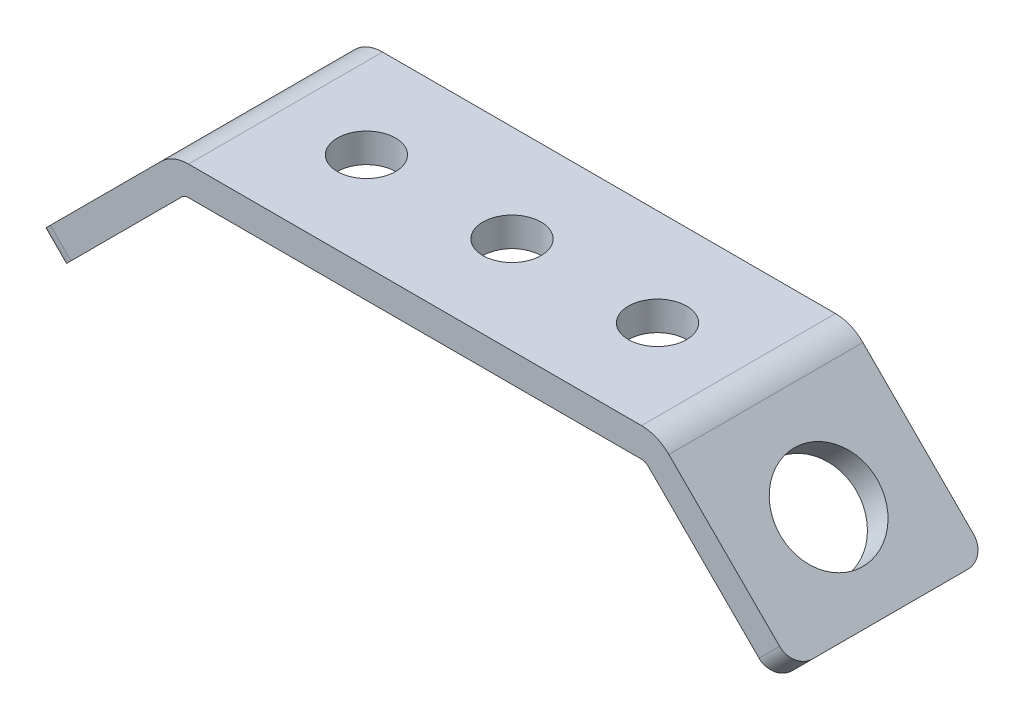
ISO-10303-21;
HEADER;
FILE_DESCRIPTION(('STEP AP214'),'2;1');
FILE_NAME('part.step','',(''),(''),'','','');
FILE_SCHEMA(('AUTOMOTIVE_DESIGN { 1 0 10303 214 1 1 1 1 }'));
ENDSEC;
DATA;
#1=APPLICATION_CONTEXT('core data for automotive mechanical design processes');
#2=APPLICATION_PROTOCOL_DEFINITION('international standard','automotive_design',2000,#1);
#3=PRODUCT_CONTEXT('',#1,'mechanical');
#4=PRODUCT('Part','Part','',(#3));
#5=PRODUCT_RELATED_PRODUCT_CATEGORY('part','',(#4));
#6=PRODUCT_DEFINITION_FORMATION('','',#4);
#7=PRODUCT_DEFINITION_CONTEXT('part definition',#1,'design');
#8=PRODUCT_DEFINITION('design','',#6,#7);
#9=PRODUCT_DEFINITION_SHAPE('','',#8);
#10=(LENGTH_UNIT() NAMED_UNIT(*) SI_UNIT(.MILLI.,.METRE.));
#11=(NAMED_UNIT(*) PLANE_ANGLE_UNIT() SI_UNIT($,.RADIAN.));
#12=(NAMED_UNIT(*) SI_UNIT($,.STERADIAN.) SOLID_ANGLE_UNIT());
#13=UNCERTAINTY_MEASURE_WITH_UNIT(LENGTH_MEASURE(1.E-05),#10,'distance_accuracy_value','');
#14=(GEOMETRIC_REPRESENTATION_CONTEXT(3) GLOBAL_UNCERTAINTY_ASSIGNED_CONTEXT((#13)) GLOBAL_UNIT_ASSIGNED_CONTEXT((#10,
#11,#12)) REPRESENTATION_CONTEXT('',''));
#15=CARTESIAN_POINT('',(0.,0.,0.));
#16=DIRECTION('',(0.,0.,1.));
#17=DIRECTION('',(1.,0.,0.));
#18=AXIS2_PLACEMENT_3D('',#15,#16,#17);
#19=CARTESIAN_POINT('',(-24.0502525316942,-3.29289321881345,10.));
#20=DIRECTION('',(0.707106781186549,-0.707106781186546,0.));
#21=DIRECTION('',(0.707106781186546,0.707106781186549,0.));
#22=AXIS2_PLACEMENT_3D('',#19,#20,#21);
#23=PLANE('',#22);
#24=DIRECTION('',(-0.707106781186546,-0.707106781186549,0.));
#25=VECTOR('',#24,1.);
#26=CARTESIAN_POINT('',(-24.0502525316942,-3.29289321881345,10.));
#27=LINE('',#26,#25);
#28=CARTESIAN_POINT('',(-24.0502525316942,-3.29289321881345,10.));
#29=VERTEX_POINT('',#28);
#30=CARTESIAN_POINT('',(-35.4644660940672,-14.7071067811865,10.));
#31=VERTEX_POINT('',#30);
#32=EDGE_CURVE('E219',#29,#31,#27,.T.);
#33=ORIENTED_EDGE('',*,*,#32,.T.);
#34=CARTESIAN_POINT('',(-35.4644660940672,-14.7071067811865,8.));
#35=DIRECTION('',(0.707106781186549,-0.707106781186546,0.));
#36=DIRECTION('',(0.707106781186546,0.707106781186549,0.));
#37=AXIS2_PLACEMENT_3D('',#34,#35,#36);
#38=CIRCLE('',#37,2.);
#39=CARTESIAN_POINT('',(-36.8786796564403,-16.1213203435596,8.));
#40=VERTEX_POINT('',#39);
#41=EDGE_CURVE('E264',#31,#40,#38,.T.);
#42=ORIENTED_EDGE('',*,*,#41,.T.);
#43=DIRECTION('',(0.,0.,-1.));
#44=VECTOR('',#43,1.);
#45=CARTESIAN_POINT('',(-36.8786796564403,-16.1213203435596,10.));
#46=LINE('',#45,#44);
#47=CARTESIAN_POINT('',(-36.8786796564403,-16.1213203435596,-8.));
#48=VERTEX_POINT('',#47);
#49=EDGE_CURVE('E222',#40,#48,#46,.T.);
#50=ORIENTED_EDGE('',*,*,#49,.T.);
#51=CARTESIAN_POINT('',(-35.4644660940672,-14.7071067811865,-8.));
#52=DIRECTION('',(0.707106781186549,-0.707106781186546,0.));
#53=DIRECTION('',(0.707106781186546,0.707106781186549,0.));
#54=AXIS2_PLACEMENT_3D('',#51,#52,#53);
#55=CIRCLE('',#54,2.);
#56=CARTESIAN_POINT('',(-35.4644660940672,-14.7071067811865,-10.));
#57=VERTEX_POINT('',#56);
#58=EDGE_CURVE('E262',#48,#57,#55,.T.);
#59=ORIENTED_EDGE('',*,*,#58,.T.);
#60=DIRECTION('',(-0.707106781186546,-0.707106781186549,0.));
#61=VECTOR('',#60,1.);
#62=CARTESIAN_POINT('',(-24.0502525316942,-3.29289321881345,-10.));
#63=LINE('',#62,#61);
#64=CARTESIAN_POINT('',(-24.0502525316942,-3.29289321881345,-10.));
#65=VERTEX_POINT('',#64);
#66=EDGE_CURVE('E197',#65,#57,#63,.T.);
#67=ORIENTED_EDGE('',*,*,#66,.F.);
#68=DIRECTION('',(0.,0.,-1.));
#69=VECTOR('',#68,1.);
#70=CARTESIAN_POINT('',(-24.0502525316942,-3.29289321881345,10.));
#71=LINE('',#70,#69);
#72=EDGE_CURVE('E226',#29,#65,#71,.T.);
#73=ORIENTED_EDGE('',*,*,#72,.F.);
#74=EDGE_LOOP('',(#33,#42,#50,#59,#67,#73));
#75=FACE_BOUND('',#74,.T.);
#76=CARTESIAN_POINT('',(-30.5147186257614,-9.7573593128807,0.));
#77=DIRECTION('',(0.707106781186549,-0.707106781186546,0.));
#78=DIRECTION('',(0.707106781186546,0.707106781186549,0.));
#79=AXIS2_PLACEMENT_3D('',#76,#77,#78);
#80=CIRCLE('',#79,5.);
#81=CARTESIAN_POINT('',(-26.9791847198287,-6.22182540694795,0.));
#82=VERTEX_POINT('',#81);
#83=EDGE_CURVE('E426',#82,#82,#80,.T.);
#84=ORIENTED_EDGE('',*,*,#83,.F.);
#85=EDGE_LOOP('',(#84));
#86=FACE_BOUND('',#85,.T.);
#87=ADVANCED_FACE('F32',(#75,#86),#23,.T.);
#88=CARTESIAN_POINT('',(-26.1715728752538,-1.17157287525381,10.));
#89=DIRECTION('',(0.707106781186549,-0.707106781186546,0.));
#90=DIRECTION('',(0.707106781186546,0.707106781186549,0.));
#91=AXIS2_PLACEMENT_3D('',#88,#89,#90);
#92=PLANE('',#91);
#93=DIRECTION('',(0.,0.,-1.));
#94=VECTOR('',#93,1.);
#95=CARTESIAN_POINT('',(-38.9999999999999,-14.,10.));
#96=LINE('',#95,#94);
#97=CARTESIAN_POINT('',(-38.9999999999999,-14.,8.));
#98=VERTEX_POINT('',#97);
#99=CARTESIAN_POINT('',(-38.9999999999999,-14.,-8.));
#100=VERTEX_POINT('',#99);
#101=EDGE_CURVE('E167',#98,#100,#96,.T.);
#102=ORIENTED_EDGE('',*,*,#101,.F.);
#103=CARTESIAN_POINT('',(-37.5857864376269,-12.5857864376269,8.));
#104=DIRECTION('',(0.707106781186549,-0.707106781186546,0.));
#105=DIRECTION('',(0.707106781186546,0.707106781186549,0.));
#106=AXIS2_PLACEMENT_3D('',#103,#104,#105);
#107=CIRCLE('',#106,2.);
#108=CARTESIAN_POINT('',(-37.5857864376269,-12.5857864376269,10.));
#109=VERTEX_POINT('',#108);
#110=EDGE_CURVE('E255',#98,#109,#107,.F.);
#111=ORIENTED_EDGE('',*,*,#110,.T.);
#112=DIRECTION('',(-0.707106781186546,-0.707106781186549,0.));
#113=VECTOR('',#112,1.);
#114=CARTESIAN_POINT('',(-26.1715728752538,-1.17157287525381,10.));
#115=LINE('',#114,#113);
#116=CARTESIAN_POINT('',(-26.1715728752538,-1.17157287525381,10.));
#117=VERTEX_POINT('',#116);
#118=EDGE_CURVE('E166',#117,#109,#115,.T.);
#119=ORIENTED_EDGE('',*,*,#118,.F.);
#120=DIRECTION('',(0.,0.,-1.));
#121=VECTOR('',#120,1.);
#122=CARTESIAN_POINT('',(-26.1715728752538,-1.17157287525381,10.));
#123=LINE('',#122,#121);
#124=CARTESIAN_POINT('',(-26.1715728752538,-1.17157287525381,-10.));
#125=VERTEX_POINT('',#124);
#126=EDGE_CURVE('E150',#117,#125,#123,.T.);
#127=ORIENTED_EDGE('',*,*,#126,.T.);
#128=DIRECTION('',(-0.707106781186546,-0.707106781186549,0.));
#129=VECTOR('',#128,1.);
#130=CARTESIAN_POINT('',(-26.1715728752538,-1.17157287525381,-10.));
#131=LINE('',#130,#129);
#132=CARTESIAN_POINT('',(-37.5857864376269,-12.5857864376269,-10.));
#133=VERTEX_POINT('',#132);
#134=EDGE_CURVE('E158',#125,#133,#131,.T.);
#135=ORIENTED_EDGE('',*,*,#134,.T.);
#136=CARTESIAN_POINT('',(-37.5857864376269,-12.5857864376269,-8.));
#137=DIRECTION('',(0.707106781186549,-0.707106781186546,0.));
#138=DIRECTION('',(0.707106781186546,0.707106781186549,0.));
#139=AXIS2_PLACEMENT_3D('',#136,#137,#138);
#140=CIRCLE('',#139,2.);
#141=EDGE_CURVE('E253',#133,#100,#140,.F.);
#142=ORIENTED_EDGE('',*,*,#141,.T.);
#143=EDGE_LOOP('',(#102,#111,#119,#127,#135,#142));
#144=FACE_BOUND('',#143,.T.);
#145=CARTESIAN_POINT('',(-32.636038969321,-7.63603896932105,0.));
#146=DIRECTION('',(0.707106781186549,-0.707106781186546,0.));
#147=DIRECTION('',(0.707106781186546,0.707106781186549,0.));
#148=AXIS2_PLACEMENT_3D('',#145,#146,#147);
#149=CIRCLE('',#148,5.);
#150=CARTESIAN_POINT('',(-29.1005050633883,-4.10050506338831,0.));
#151=VERTEX_POINT('',#150);
#152=EDGE_CURVE('E430',#151,#151,#149,.T.);
#153=ORIENTED_EDGE('',*,*,#152,.T.);
#154=EDGE_LOOP('',(#153));
#155=FACE_BOUND('',#154,.T.);
#156=ADVANCED_FACE('F163',(#144,#155),#92,.F.);
#157=CARTESIAN_POINT('',(-23.3431457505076,-3.,10.));
#158=DIRECTION('',(0.,-1.,0.));
#159=DIRECTION('',(0.,0.,-1.));
#160=AXIS2_PLACEMENT_3D('',#157,#158,#159);
#161=PLANE('',#160);
#162=DIRECTION('',(1.,0.,0.));
#163=VECTOR('',#162,1.);
#164=CARTESIAN_POINT('',(-23.3431457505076,-3.,-10.));
#165=LINE('',#164,#163);
#166=CARTESIAN_POINT('',(23.3431457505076,-3.,-10.));
#167=VERTEX_POINT('',#166);
#168=CARTESIAN_POINT('',(-23.3431457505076,-3.,-10.));
#169=VERTEX_POINT('',#168);
#170=EDGE_CURVE('E191',#167,#169,#165,.F.);
#171=ORIENTED_EDGE('',*,*,#170,.F.);
#172=DIRECTION('',(0.,0.,-1.));
#173=VECTOR('',#172,1.);
#174=CARTESIAN_POINT('',(23.3431457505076,-3.,10.));
#175=LINE('',#174,#173);
#176=CARTESIAN_POINT('',(23.3431457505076,-3.,10.));
#177=VERTEX_POINT('',#176);
#178=EDGE_CURVE('E230',#177,#167,#175,.T.);
#179=ORIENTED_EDGE('',*,*,#178,.F.);
#180=DIRECTION('',(1.,0.,0.));
#181=VECTOR('',#180,1.);
#182=CARTESIAN_POINT('',(-23.3431457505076,-3.,10.));
#183=LINE('',#182,#181);
#184=CARTESIAN_POINT('',(-23.3431457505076,-3.,10.));
#185=VERTEX_POINT('',#184);
#186=EDGE_CURVE('E213',#177,#185,#183,.F.);
#187=ORIENTED_EDGE('',*,*,#186,.T.);
#188=DIRECTION('',(0.,0.,-1.));
#189=VECTOR('',#188,1.);
#190=CARTESIAN_POINT('',(-23.3431457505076,-3.,10.));
#191=LINE('',#190,#189);
#192=EDGE_CURVE('E228',#185,#169,#191,.T.);
#193=ORIENTED_EDGE('',*,*,#192,.T.);
#194=EDGE_LOOP('',(#171,#179,#187,#193));
#195=FACE_BOUND('',#194,.T.);
#196=CARTESIAN_POINT('',(0.,-3.,0.));
#197=DIRECTION('',(0.,-1.,0.));
#198=DIRECTION('',(0.,0.,-1.));
#199=AXIS2_PLACEMENT_3D('',#196,#197,#198);
#200=CIRCLE('',#199,3.);
#201=CARTESIAN_POINT('',(0.,-3.,-3.));
#202=VERTEX_POINT('',#201);
#203=EDGE_CURVE('E174',#202,#202,#200,.T.);
#204=ORIENTED_EDGE('',*,*,#203,.F.);
#205=EDGE_LOOP('',(#204));
#206=FACE_BOUND('',#205,.T.);
#207=CARTESIAN_POINT('',(15.,-3.,0.));
#208=DIRECTION('',(0.,-1.,0.));
#209=DIRECTION('',(0.,0.,-1.));
#210=AXIS2_PLACEMENT_3D('',#207,#208,#209);
#211=CIRCLE('',#210,3.);
#212=CARTESIAN_POINT('',(15.,-3.,-3.));
#213=VERTEX_POINT('',#212);
#214=EDGE_CURVE('E417',#213,#213,#211,.T.);
#215=ORIENTED_EDGE('',*,*,#214,.F.);
#216=EDGE_LOOP('',(#215));
#217=FACE_BOUND('',#216,.T.);
#218=CARTESIAN_POINT('',(-15.,-3.,0.));
#219=DIRECTION('',(0.,-1.,0.));
#220=DIRECTION('',(0.,0.,-1.));
#221=AXIS2_PLACEMENT_3D('',#218,#219,#220);
#222=CIRCLE('',#221,2.99999999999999);
#223=CARTESIAN_POINT('',(-15.,-3.,-3.));
#224=VERTEX_POINT('',#223);
#225=EDGE_CURVE('E406',#224,#224,#222,.F.);
#226=ORIENTED_EDGE('',*,*,#225,.T.);
#227=EDGE_LOOP('',(#226));
#228=FACE_BOUND('',#227,.T.);
#229=ADVANCED_FACE('F319',(#195,#206,#217,#228),#161,.T.);
#230=CARTESIAN_POINT('',(-23.3431457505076,0.,10.));
#231=DIRECTION('',(0.,-1.,0.));
#232=DIRECTION('',(0.,0.,-1.));
#233=AXIS2_PLACEMENT_3D('',#230,#231,#232);
#234=PLANE('',#233);
#235=DIRECTION('',(-1.,0.,0.));
#236=VECTOR('',#235,1.);
#237=CARTESIAN_POINT('',(-23.3431457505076,0.,-10.));
#238=LINE('',#237,#236);
#239=CARTESIAN_POINT('',(23.3431457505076,0.,-10.));
#240=VERTEX_POINT('',#239);
#241=CARTESIAN_POINT('',(-23.3431457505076,0.,-10.));
#242=VERTEX_POINT('',#241);
#243=EDGE_CURVE('E157',#240,#242,#238,.T.);
#244=ORIENTED_EDGE('',*,*,#243,.T.);
#245=DIRECTION('',(0.,0.,-1.));
#246=VECTOR('',#245,1.);
#247=CARTESIAN_POINT('',(-23.3431457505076,0.,10.));
#248=LINE('',#247,#246);
#249=CARTESIAN_POINT('',(-23.3431457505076,0.,10.));
#250=VERTEX_POINT('',#249);
#251=EDGE_CURVE('E153',#250,#242,#248,.T.);
#252=ORIENTED_EDGE('',*,*,#251,.F.);
#253=DIRECTION('',(-1.,0.,0.));
#254=VECTOR('',#253,1.);
#255=CARTESIAN_POINT('',(-23.3431457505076,0.,10.));
#256=LINE('',#255,#254);
#257=CARTESIAN_POINT('',(23.3431457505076,0.,10.));
#258=VERTEX_POINT('',#257);
#259=EDGE_CURVE('E202',#258,#250,#256,.T.);
#260=ORIENTED_EDGE('',*,*,#259,.F.);
#261=DIRECTION('',(0.,0.,-1.));
#262=VECTOR('',#261,1.);
#263=CARTESIAN_POINT('',(23.3431457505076,0.,10.));
#264=LINE('',#263,#262);
#265=EDGE_CURVE('E243',#258,#240,#264,.T.);
#266=ORIENTED_EDGE('',*,*,#265,.T.);
#267=EDGE_LOOP('',(#244,#252,#260,#266));
#268=FACE_BOUND('',#267,.T.);
#269=CARTESIAN_POINT('',(0.,0.,0.));
#270=DIRECTION('',(0.,1.,0.));
#271=DIRECTION('',(0.,0.,1.));
#272=AXIS2_PLACEMENT_3D('',#269,#270,#271);
#273=CIRCLE('',#272,3.);
#274=CARTESIAN_POINT('',(0.,0.,3.));
#275=VERTEX_POINT('',#274);
#276=EDGE_CURVE('E177',#275,#275,#273,.T.);
#277=ORIENTED_EDGE('',*,*,#276,.F.);
#278=EDGE_LOOP('',(#277));
#279=FACE_BOUND('',#278,.T.);
#280=CARTESIAN_POINT('',(15.,0.,0.));
#281=DIRECTION('',(0.,1.,0.));
#282=DIRECTION('',(0.,0.,1.));
#283=AXIS2_PLACEMENT_3D('',#280,#281,#282);
#284=CIRCLE('',#283,3.);
#285=CARTESIAN_POINT('',(15.,0.,3.));
#286=VERTEX_POINT('',#285);
#287=EDGE_CURVE('E401',#286,#286,#284,.T.);
#288=ORIENTED_EDGE('',*,*,#287,.F.);
#289=EDGE_LOOP('',(#288));
#290=FACE_BOUND('',#289,.T.);
#291=CARTESIAN_POINT('',(-15.,0.,0.));
#292=DIRECTION('',(0.,-1.,0.));
#293=DIRECTION('',(0.,0.,-1.));
#294=AXIS2_PLACEMENT_3D('',#291,#292,#293);
#295=CIRCLE('',#294,2.99999999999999);
#296=CARTESIAN_POINT('',(-15.,0.,-3.));
#297=VERTEX_POINT('',#296);
#298=EDGE_CURVE('E404',#297,#297,#295,.T.);
#299=ORIENTED_EDGE('',*,*,#298,.T.);
#300=EDGE_LOOP('',(#299));
#301=FACE_BOUND('',#300,.T.);
#302=ADVANCED_FACE('F330',(#268,#279,#290,#301),#234,.F.);
#303=CARTESIAN_POINT('',(-36.8786796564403,-16.1213203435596,10.));
#304=DIRECTION('',(-0.707106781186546,-0.707106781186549,0.));
#305=DIRECTION('',(0.707106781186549,-0.707106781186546,0.));
#306=AXIS2_PLACEMENT_3D('',#303,#304,#305);
#307=PLANE('',#306);
#308=ORIENTED_EDGE('',*,*,#49,.F.);
#309=DIRECTION('',(-0.707106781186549,0.707106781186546,0.));
#310=VECTOR('',#309,1.);
#311=CARTESIAN_POINT('',(-36.8786796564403,-16.1213203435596,8.));
#312=LINE('',#311,#310);
#313=EDGE_CURVE('E250',#40,#98,#312,.T.);
#314=ORIENTED_EDGE('',*,*,#313,.T.);
#315=ORIENTED_EDGE('',*,*,#101,.T.);
#316=DIRECTION('',(-0.707106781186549,0.707106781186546,0.));
#317=VECTOR('',#316,1.);
#318=CARTESIAN_POINT('',(-36.8786796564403,-16.1213203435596,-8.));
#319=LINE('',#318,#317);
#320=EDGE_CURVE('E225',#100,#48,#319,.F.);
#321=ORIENTED_EDGE('',*,*,#320,.T.);
#322=EDGE_LOOP('',(#308,#314,#315,#321));
#323=FACE_BOUND('',#322,.T.);
#324=ADVANCED_FACE('F34',(#323),#307,.T.);
#325=CARTESIAN_POINT('',(-23.3431457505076,-4.,10.));
#326=DIRECTION('',(0.,0.,-1.));
#327=DIRECTION('',(-1.,0.,0.));
#328=AXIS2_PLACEMENT_3D('',#325,#326,#327);
#329=CYLINDRICAL_SURFACE('',#328,1.);
#330=CARTESIAN_POINT('',(-23.3431457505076,-4.,-10.));
#331=DIRECTION('',(0.,0.,1.));
#332=DIRECTION('',(1.,0.,0.));
#333=AXIS2_PLACEMENT_3D('',#330,#331,#332);
#334=CIRCLE('',#333,1.);
#335=EDGE_CURVE('E194',#169,#65,#334,.T.);
#336=ORIENTED_EDGE('',*,*,#335,.F.);
#337=ORIENTED_EDGE('',*,*,#192,.F.);
#338=CARTESIAN_POINT('',(-23.3431457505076,-4.,10.));
#339=DIRECTION('',(0.,0.,1.));
#340=DIRECTION('',(1.,0.,0.));
#341=AXIS2_PLACEMENT_3D('',#338,#339,#340);
#342=CIRCLE('',#341,1.);
#343=EDGE_CURVE('E216',#185,#29,#342,.T.);
#344=ORIENTED_EDGE('',*,*,#343,.T.);
#345=ORIENTED_EDGE('',*,*,#72,.T.);
#346=EDGE_LOOP('',(#336,#337,#344,#345));
#347=FACE_BOUND('',#346,.T.);
#348=ADVANCED_FACE('F324',(#347),#329,.F.);
#349=CARTESIAN_POINT('',(23.3431457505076,-4.,10.));
#350=DIRECTION('',(0.,0.,-1.));
#351=DIRECTION('',(-1.,0.,0.));
#352=AXIS2_PLACEMENT_3D('',#349,#350,#351);
#353=CYLINDRICAL_SURFACE('',#352,1.);
#354=CARTESIAN_POINT('',(23.3431457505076,-4.,-10.));
#355=DIRECTION('',(0.,0.,1.));
#356=DIRECTION('',(1.,0.,0.));
#357=AXIS2_PLACEMENT_3D('',#354,#355,#356);
#358=CIRCLE('',#357,1.);
#359=CARTESIAN_POINT('',(24.0502525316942,-3.29289321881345,-10.));
#360=VERTEX_POINT('',#359);
#361=EDGE_CURVE('E188',#360,#167,#358,.T.);
#362=ORIENTED_EDGE('',*,*,#361,.F.);
#363=DIRECTION('',(0.,0.,-1.));
#364=VECTOR('',#363,1.);
#365=CARTESIAN_POINT('',(24.0502525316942,-3.29289321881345,10.));
#366=LINE('',#365,#364);
#367=CARTESIAN_POINT('',(24.0502525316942,-3.29289321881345,10.));
#368=VERTEX_POINT('',#367);
#369=EDGE_CURVE('E232',#368,#360,#366,.T.);
#370=ORIENTED_EDGE('',*,*,#369,.F.);
#371=CARTESIAN_POINT('',(23.3431457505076,-4.,10.));
#372=DIRECTION('',(0.,0.,1.));
#373=DIRECTION('',(1.,0.,0.));
#374=AXIS2_PLACEMENT_3D('',#371,#372,#373);
#375=CIRCLE('',#374,1.);
#376=EDGE_CURVE('E210',#368,#177,#375,.T.);
#377=ORIENTED_EDGE('',*,*,#376,.T.);
#378=ORIENTED_EDGE('',*,*,#178,.T.);
#379=EDGE_LOOP('',(#362,#370,#377,#378));
#380=FACE_BOUND('',#379,.T.);
#381=ADVANCED_FACE('F297',(#380),#353,.F.);
#382=CARTESIAN_POINT('',(24.0502525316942,-3.29289321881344,10.));
#383=DIRECTION('',(-0.707106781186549,-0.707106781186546,0.));
#384=DIRECTION('',(0.707106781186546,-0.707106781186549,0.));
#385=AXIS2_PLACEMENT_3D('',#382,#383,#384);
#386=PLANE('',#385);
#387=CARTESIAN_POINT('',(30.5147186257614,-9.75735931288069,0.));
#388=DIRECTION('',(-0.707106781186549,-0.707106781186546,0.));
#389=DIRECTION('',(0.707106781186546,-0.707106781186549,0.));
#390=AXIS2_PLACEMENT_3D('',#387,#388,#389);
#391=CIRCLE('',#390,5.);
#392=CARTESIAN_POINT('',(34.0502525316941,-13.2928932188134,0.));
#393=VERTEX_POINT('',#392);
#394=EDGE_CURVE('E412',#393,#393,#391,.F.);
#395=ORIENTED_EDGE('',*,*,#394,.T.);
#396=EDGE_LOOP('',(#395));
#397=FACE_BOUND('',#396,.T.);
#398=DIRECTION('',(0.,0.,-1.));
#399=VECTOR('',#398,1.);
#400=CARTESIAN_POINT('',(36.8786796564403,-16.1213203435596,10.));
#401=LINE('',#400,#399);
#402=CARTESIAN_POINT('',(36.8786796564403,-16.1213203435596,8.));
#403=VERTEX_POINT('',#402);
#404=CARTESIAN_POINT('',(36.8786796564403,-16.1213203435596,-8.));
#405=VERTEX_POINT('',#404);
#406=EDGE_CURVE('E235',#403,#405,#401,.T.);
#407=ORIENTED_EDGE('',*,*,#406,.F.);
#408=CARTESIAN_POINT('',(35.4644660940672,-14.7071067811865,8.));
#409=DIRECTION('',(-0.707106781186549,-0.707106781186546,0.));
#410=DIRECTION('',(0.707106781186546,-0.707106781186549,0.));
#411=AXIS2_PLACEMENT_3D('',#408,#409,#410);
#412=CIRCLE('',#411,2.);
#413=CARTESIAN_POINT('',(35.4644660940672,-14.7071067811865,10.));
#414=VERTEX_POINT('',#413);
#415=EDGE_CURVE('E11',#403,#414,#412,.T.);
#416=ORIENTED_EDGE('',*,*,#415,.T.);
#417=DIRECTION('',(-0.707106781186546,0.707106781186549,0.));
#418=VECTOR('',#417,1.);
#419=CARTESIAN_POINT('',(24.0502525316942,-3.29289321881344,10.));
#420=LINE('',#419,#418);
#421=EDGE_CURVE('E208',#414,#368,#420,.T.);
#422=ORIENTED_EDGE('',*,*,#421,.T.);
#423=ORIENTED_EDGE('',*,*,#369,.T.);
#424=DIRECTION('',(-0.707106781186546,0.707106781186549,0.));
#425=VECTOR('',#424,1.);
#426=CARTESIAN_POINT('',(24.0502525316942,-3.29289321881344,-10.));
#427=LINE('',#426,#425);
#428=CARTESIAN_POINT('',(35.4644660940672,-14.7071067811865,-10.));
#429=VERTEX_POINT('',#428);
#430=EDGE_CURVE('E186',#429,#360,#427,.T.);
#431=ORIENTED_EDGE('',*,*,#430,.F.);
#432=CARTESIAN_POINT('',(35.4644660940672,-14.7071067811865,-8.));
#433=DIRECTION('',(-0.707106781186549,-0.707106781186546,0.));
#434=DIRECTION('',(0.707106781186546,-0.707106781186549,0.));
#435=AXIS2_PLACEMENT_3D('',#432,#433,#434);
#436=CIRCLE('',#435,2.);
#437=EDGE_CURVE('E40',#429,#405,#436,.T.);
#438=ORIENTED_EDGE('',*,*,#437,.T.);
#439=EDGE_LOOP('',(#407,#416,#422,#423,#431,#438));
#440=FACE_BOUND('',#439,.T.);
#441=ADVANCED_FACE('F294',(#397,#440),#386,.T.);
#442=CARTESIAN_POINT('',(36.8786796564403,-16.1213203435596,10.));
#443=DIRECTION('',(-0.707106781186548,0.707106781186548,0.));
#444=DIRECTION('',(-0.707106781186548,-0.707106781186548,0.));
#445=AXIS2_PLACEMENT_3D('',#442,#443,#444);
#446=PLANE('',#445);
#447=DIRECTION('',(0.,0.,-1.));
#448=VECTOR('',#447,1.);
#449=CARTESIAN_POINT('',(38.9999999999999,-14.,10.));
#450=LINE('',#449,#448);
#451=CARTESIAN_POINT('',(38.9999999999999,-14.,8.));
#452=VERTEX_POINT('',#451);
#453=CARTESIAN_POINT('',(38.9999999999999,-14.,-8.));
#454=VERTEX_POINT('',#453);
#455=EDGE_CURVE('E237',#452,#454,#450,.T.);
#456=ORIENTED_EDGE('',*,*,#455,.F.);
#457=DIRECTION('',(0.707106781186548,0.707106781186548,0.));
#458=VECTOR('',#457,1.);
#459=CARTESIAN_POINT('',(36.8786796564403,-16.1213203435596,8.));
#460=LINE('',#459,#458);
#461=EDGE_CURVE('E53',#452,#403,#460,.F.);
#462=ORIENTED_EDGE('',*,*,#461,.T.);
#463=ORIENTED_EDGE('',*,*,#406,.T.);
#464=DIRECTION('',(0.707106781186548,0.707106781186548,0.));
#465=VECTOR('',#464,1.);
#466=CARTESIAN_POINT('',(36.8786796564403,-16.1213203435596,-8.));
#467=LINE('',#466,#465);
#468=EDGE_CURVE('E273',#405,#454,#467,.T.);
#469=ORIENTED_EDGE('',*,*,#468,.T.);
#470=EDGE_LOOP('',(#456,#462,#463,#469));
#471=FACE_BOUND('',#470,.T.);
#472=ADVANCED_FACE('F277',(#471),#446,.F.);
#473=CARTESIAN_POINT('',(26.1715728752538,-1.17157287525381,10.));
#474=DIRECTION('',(-0.707106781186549,-0.707106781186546,0.));
#475=DIRECTION('',(0.707106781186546,-0.707106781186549,0.));
#476=AXIS2_PLACEMENT_3D('',#473,#474,#475);
#477=PLANE('',#476);
#478=CARTESIAN_POINT('',(32.636038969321,-7.63603896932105,0.));
#479=DIRECTION('',(0.707106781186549,0.707106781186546,0.));
#480=DIRECTION('',(-0.707106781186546,0.707106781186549,0.));
#481=AXIS2_PLACEMENT_3D('',#478,#479,#480);
#482=CIRCLE('',#481,5.);
#483=CARTESIAN_POINT('',(29.1005050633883,-4.10050506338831,0.));
#484=VERTEX_POINT('',#483);
#485=EDGE_CURVE('E407',#484,#484,#482,.T.);
#486=ORIENTED_EDGE('',*,*,#485,.F.);
#487=EDGE_LOOP('',(#486));
#488=FACE_BOUND('',#487,.T.);
#489=DIRECTION('',(-0.707106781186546,0.707106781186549,0.));
#490=VECTOR('',#489,1.);
#491=CARTESIAN_POINT('',(26.1715728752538,-1.17157287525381,10.));
#492=LINE('',#491,#490);
#493=CARTESIAN_POINT('',(37.5857864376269,-12.5857864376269,10.));
#494=VERTEX_POINT('',#493);
#495=CARTESIAN_POINT('',(26.1715728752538,-1.17157287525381,10.));
#496=VERTEX_POINT('',#495);
#497=EDGE_CURVE('E206',#494,#496,#492,.T.);
#498=ORIENTED_EDGE('',*,*,#497,.F.);
#499=CARTESIAN_POINT('',(37.5857864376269,-12.5857864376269,8.));
#500=DIRECTION('',(-0.707106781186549,-0.707106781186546,0.));
#501=DIRECTION('',(0.707106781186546,-0.707106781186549,0.));
#502=AXIS2_PLACEMENT_3D('',#499,#500,#501);
#503=CIRCLE('',#502,2.);
#504=EDGE_CURVE('E271',#494,#452,#503,.F.);
#505=ORIENTED_EDGE('',*,*,#504,.T.);
#506=ORIENTED_EDGE('',*,*,#455,.T.);
#507=CARTESIAN_POINT('',(37.5857864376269,-12.5857864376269,-8.));
#508=DIRECTION('',(-0.707106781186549,-0.707106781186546,0.));
#509=DIRECTION('',(0.707106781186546,-0.707106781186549,0.));
#510=AXIS2_PLACEMENT_3D('',#507,#508,#509);
#511=CIRCLE('',#510,2.);
#512=CARTESIAN_POINT('',(37.5857864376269,-12.5857864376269,-10.));
#513=VERTEX_POINT('',#512);
#514=EDGE_CURVE('E269',#454,#513,#511,.F.);
#515=ORIENTED_EDGE('',*,*,#514,.T.);
#516=DIRECTION('',(-0.707106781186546,0.707106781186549,0.));
#517=VECTOR('',#516,1.);
#518=CARTESIAN_POINT('',(26.1715728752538,-1.17157287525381,-10.));
#519=LINE('',#518,#517);
#520=CARTESIAN_POINT('',(26.1715728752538,-1.17157287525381,-10.));
#521=VERTEX_POINT('',#520);
#522=EDGE_CURVE('E184',#513,#521,#519,.T.);
#523=ORIENTED_EDGE('',*,*,#522,.T.);
#524=DIRECTION('',(0.,0.,-1.));
#525=VECTOR('',#524,1.);
#526=CARTESIAN_POINT('',(26.1715728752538,-1.17157287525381,10.));
#527=LINE('',#526,#525);
#528=EDGE_CURVE('E240',#496,#521,#527,.T.);
#529=ORIENTED_EDGE('',*,*,#528,.F.);
#530=EDGE_LOOP('',(#498,#505,#506,#515,#523,#529));
#531=FACE_BOUND('',#530,.T.);
#532=ADVANCED_FACE('F281',(#488,#531),#477,.F.);
#533=CARTESIAN_POINT('',(23.3431457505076,-4.,10.));
#534=DIRECTION('',(0.,0.,-1.));
#535=DIRECTION('',(-1.,0.,0.));
#536=AXIS2_PLACEMENT_3D('',#533,#534,#535);
#537=CYLINDRICAL_SURFACE('',#536,4.);
#538=CARTESIAN_POINT('',(23.3431457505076,-4.,-10.));
#539=DIRECTION('',(0.,0.,1.));
#540=DIRECTION('',(-1.,0.,0.));
#541=AXIS2_PLACEMENT_3D('',#538,#539,#540);
#542=CIRCLE('',#541,4.);
#543=EDGE_CURVE('E182',#521,#240,#542,.T.);
#544=ORIENTED_EDGE('',*,*,#543,.T.);
#545=ORIENTED_EDGE('',*,*,#265,.F.);
#546=CARTESIAN_POINT('',(23.3431457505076,-4.,10.));
#547=DIRECTION('',(0.,0.,1.));
#548=DIRECTION('',(-1.,0.,0.));
#549=AXIS2_PLACEMENT_3D('',#546,#547,#548);
#550=CIRCLE('',#549,4.);
#551=EDGE_CURVE('E204',#496,#258,#550,.T.);
#552=ORIENTED_EDGE('',*,*,#551,.F.);
#553=ORIENTED_EDGE('',*,*,#528,.T.);
#554=EDGE_LOOP('',(#544,#545,#552,#553));
#555=FACE_BOUND('',#554,.T.);
#556=ADVANCED_FACE('F341',(#555),#537,.T.);
#557=CARTESIAN_POINT('',(-23.3431457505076,-4.,10.));
#558=DIRECTION('',(0.,0.,-1.));
#559=DIRECTION('',(-1.,0.,0.));
#560=AXIS2_PLACEMENT_3D('',#557,#558,#559);
#561=CYLINDRICAL_SURFACE('',#560,4.);
#562=CARTESIAN_POINT('',(-23.3431457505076,-4.,-10.));
#563=DIRECTION('',(0.,0.,1.));
#564=DIRECTION('',(1.,0.,0.));
#565=AXIS2_PLACEMENT_3D('',#562,#563,#564);
#566=CIRCLE('',#565,4.);
#567=EDGE_CURVE('E146',#242,#125,#566,.T.);
#568=ORIENTED_EDGE('',*,*,#567,.T.);
#569=ORIENTED_EDGE('',*,*,#126,.F.);
#570=CARTESIAN_POINT('',(-23.3431457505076,-4.,10.));
#571=DIRECTION('',(0.,0.,1.));
#572=DIRECTION('',(1.,0.,0.));
#573=AXIS2_PLACEMENT_3D('',#570,#571,#572);
#574=CIRCLE('',#573,4.);
#575=EDGE_CURVE('E200',#250,#117,#574,.T.);
#576=ORIENTED_EDGE('',*,*,#575,.F.);
#577=ORIENTED_EDGE('',*,*,#251,.T.);
#578=EDGE_LOOP('',(#568,#569,#576,#577));
#579=FACE_BOUND('',#578,.T.);
#580=ADVANCED_FACE('F148',(#579),#561,.T.);
#581=CARTESIAN_POINT('',(-23.3431457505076,-4.,10.));
#582=DIRECTION('',(0.,0.,1.));
#583=DIRECTION('',(1.,0.,0.));
#584=AXIS2_PLACEMENT_3D('',#581,#582,#583);
#585=PLANE('',#584);
#586=ORIENTED_EDGE('',*,*,#118,.T.);
#587=DIRECTION('',(-0.707106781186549,0.707106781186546,0.));
#588=VECTOR('',#587,1.);
#589=CARTESIAN_POINT('',(-34.7573593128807,-15.4142135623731,10.));
#590=LINE('',#589,#588);
#591=EDGE_CURVE('E260',#109,#31,#590,.F.);
#592=ORIENTED_EDGE('',*,*,#591,.T.);
#593=ORIENTED_EDGE('',*,*,#32,.F.);
#594=ORIENTED_EDGE('',*,*,#343,.F.);
#595=ORIENTED_EDGE('',*,*,#186,.F.);
#596=ORIENTED_EDGE('',*,*,#376,.F.);
#597=ORIENTED_EDGE('',*,*,#421,.F.);
#598=DIRECTION('',(0.707106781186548,0.707106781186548,0.));
#599=VECTOR('',#598,1.);
#600=CARTESIAN_POINT('',(37.5857864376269,-12.5857864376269,10.));
#601=LINE('',#600,#599);
#602=EDGE_CURVE('E257',#414,#494,#601,.T.);
#603=ORIENTED_EDGE('',*,*,#602,.T.);
#604=ORIENTED_EDGE('',*,*,#497,.T.);
#605=ORIENTED_EDGE('',*,*,#551,.T.);
#606=ORIENTED_EDGE('',*,*,#259,.T.);
#607=ORIENTED_EDGE('',*,*,#575,.T.);
#608=EDGE_LOOP('',(#586,#592,#593,#594,#595,#596,#597,#603,#604,#605,#606,#607));
#609=FACE_BOUND('',#608,.T.);
#610=ADVANCED_FACE('F290',(#609),#585,.T.);
#611=CARTESIAN_POINT('',(-23.3431457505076,-4.,-10.));
#612=DIRECTION('',(0.,0.,1.));
#613=DIRECTION('',(1.,0.,0.));
#614=AXIS2_PLACEMENT_3D('',#611,#612,#613);
#615=PLANE('',#614);
#616=ORIENTED_EDGE('',*,*,#66,.T.);
#617=DIRECTION('',(-0.707106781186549,0.707106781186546,0.));
#618=VECTOR('',#617,1.);
#619=CARTESIAN_POINT('',(-37.5857864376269,-12.5857864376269,-10.));
#620=LINE('',#619,#618);
#621=EDGE_CURVE('E173',#57,#133,#620,.T.);
#622=ORIENTED_EDGE('',*,*,#621,.T.);
#623=ORIENTED_EDGE('',*,*,#134,.F.);
#624=ORIENTED_EDGE('',*,*,#567,.F.);
#625=ORIENTED_EDGE('',*,*,#243,.F.);
#626=ORIENTED_EDGE('',*,*,#543,.F.);
#627=ORIENTED_EDGE('',*,*,#522,.F.);
#628=DIRECTION('',(0.707106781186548,0.707106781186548,0.));
#629=VECTOR('',#628,1.);
#630=CARTESIAN_POINT('',(11.4142135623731,-38.7573593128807,-10.));
#631=LINE('',#630,#629);
#632=EDGE_CURVE('E266',#513,#429,#631,.F.);
#633=ORIENTED_EDGE('',*,*,#632,.T.);
#634=ORIENTED_EDGE('',*,*,#430,.T.);
#635=ORIENTED_EDGE('',*,*,#361,.T.);
#636=ORIENTED_EDGE('',*,*,#170,.T.);
#637=ORIENTED_EDGE('',*,*,#335,.T.);
#638=EDGE_LOOP('',(#616,#622,#623,#624,#625,#626,#627,#633,#634,#635,#636,#637));
#639=FACE_BOUND('',#638,.T.);
#640=ADVANCED_FACE('F171',(#639),#615,.F.);
#641=CARTESIAN_POINT('',(0.,-16.1213203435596,0.));
#642=DIRECTION('',(0.,1.,0.));
#643=DIRECTION('',(0.,0.,1.));
#644=AXIS2_PLACEMENT_3D('',#641,#642,#643);
#645=CYLINDRICAL_SURFACE('',#644,3.);
#646=ORIENTED_EDGE('',*,*,#203,.T.);
#647=EDGE_LOOP('',(#646));
#648=FACE_BOUND('',#647,.T.);
#649=ORIENTED_EDGE('',*,*,#276,.T.);
#650=EDGE_LOOP('',(#649));
#651=FACE_BOUND('',#650,.T.);
#652=ADVANCED_FACE('F356',(#648,#651),#645,.F.);
#653=CARTESIAN_POINT('',(15.,-16.1213203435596,0.));
#654=DIRECTION('',(0.,1.,0.));
#655=DIRECTION('',(0.,0.,1.));
#656=AXIS2_PLACEMENT_3D('',#653,#654,#655);
#657=CYLINDRICAL_SURFACE('',#656,3.);
#658=ORIENTED_EDGE('',*,*,#214,.T.);
#659=EDGE_LOOP('',(#658));
#660=FACE_BOUND('',#659,.T.);
#661=ORIENTED_EDGE('',*,*,#287,.T.);
#662=EDGE_LOOP('',(#661));
#663=FACE_BOUND('',#662,.T.);
#664=ADVANCED_FACE('F360',(#660,#663),#657,.F.);
#665=CARTESIAN_POINT('',(-15.,-16.1213203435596,0.));
#666=DIRECTION('',(0.,1.,0.));
#667=DIRECTION('',(0.,0.,1.));
#668=AXIS2_PLACEMENT_3D('',#665,#666,#667);
#669=CYLINDRICAL_SURFACE('',#668,2.99999999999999);
#670=ORIENTED_EDGE('',*,*,#225,.F.);
#671=EDGE_LOOP('',(#670));
#672=FACE_BOUND('',#671,.T.);
#673=ORIENTED_EDGE('',*,*,#298,.F.);
#674=EDGE_LOOP('',(#673));
#675=FACE_BOUND('',#674,.T.);
#676=ADVANCED_FACE('F366',(#672,#675),#669,.F.);
#677=CARTESIAN_POINT('',(-35.4644660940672,-14.7071067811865,8.));
#678=DIRECTION('',(-0.707106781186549,0.707106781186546,0.));
#679=DIRECTION('',(-0.707106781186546,-0.707106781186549,0.));
#680=AXIS2_PLACEMENT_3D('',#677,#678,#679);
#681=CYLINDRICAL_SURFACE('',#680,2.);
#682=ORIENTED_EDGE('',*,*,#41,.F.);
#683=ORIENTED_EDGE('',*,*,#591,.F.);
#684=ORIENTED_EDGE('',*,*,#110,.F.);
#685=ORIENTED_EDGE('',*,*,#313,.F.);
#686=EDGE_LOOP('',(#682,#683,#684,#685));
#687=FACE_BOUND('',#686,.T.);
#688=ADVANCED_FACE('F370',(#687),#681,.T.);
#689=CARTESIAN_POINT('',(-34.7573593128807,-15.4142135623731,-8.));
#690=DIRECTION('',(0.707106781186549,-0.707106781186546,0.));
#691=DIRECTION('',(0.707106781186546,0.707106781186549,0.));
#692=AXIS2_PLACEMENT_3D('',#689,#690,#691);
#693=CYLINDRICAL_SURFACE('',#692,2.);
#694=ORIENTED_EDGE('',*,*,#58,.F.);
#695=ORIENTED_EDGE('',*,*,#320,.F.);
#696=ORIENTED_EDGE('',*,*,#141,.F.);
#697=ORIENTED_EDGE('',*,*,#621,.F.);
#698=EDGE_LOOP('',(#694,#695,#696,#697));
#699=FACE_BOUND('',#698,.T.);
#700=ADVANCED_FACE('F311',(#699),#693,.T.);
#701=CARTESIAN_POINT('',(11.4142135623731,-38.7573593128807,8.));
#702=DIRECTION('',(-0.707106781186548,-0.707106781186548,0.));
#703=DIRECTION('',(0.707106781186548,-0.707106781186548,0.));
#704=AXIS2_PLACEMENT_3D('',#701,#702,#703);
#705=CYLINDRICAL_SURFACE('',#704,2.);
#706=ORIENTED_EDGE('',*,*,#415,.F.);
#707=ORIENTED_EDGE('',*,*,#461,.F.);
#708=ORIENTED_EDGE('',*,*,#504,.F.);
#709=ORIENTED_EDGE('',*,*,#602,.F.);
#710=EDGE_LOOP('',(#706,#707,#708,#709));
#711=FACE_BOUND('',#710,.T.);
#712=ADVANCED_FACE('F287',(#711),#705,.T.);
#713=CARTESIAN_POINT('',(35.4644660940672,-14.7071067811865,-8.));
#714=DIRECTION('',(0.707106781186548,0.707106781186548,0.));
#715=DIRECTION('',(-0.707106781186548,0.707106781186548,0.));
#716=AXIS2_PLACEMENT_3D('',#713,#714,#715);
#717=CYLINDRICAL_SURFACE('',#716,2.);
#718=ORIENTED_EDGE('',*,*,#437,.F.);
#719=ORIENTED_EDGE('',*,*,#632,.F.);
#720=ORIENTED_EDGE('',*,*,#514,.F.);
#721=ORIENTED_EDGE('',*,*,#468,.F.);
#722=EDGE_LOOP('',(#718,#719,#720,#721));
#723=FACE_BOUND('',#722,.T.);
#724=ADVANCED_FACE('F300',(#723),#717,.T.);
#725=CARTESIAN_POINT('',(-7.4256212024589,-47.6976991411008,0.));
#726=DIRECTION('',(0.707106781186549,0.707106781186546,0.));
#727=DIRECTION('',(-0.707106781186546,0.707106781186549,0.));
#728=AXIS2_PLACEMENT_3D('',#725,#726,#727);
#729=CYLINDRICAL_SURFACE('',#728,5.);
#730=ORIENTED_EDGE('',*,*,#394,.F.);
#731=EDGE_LOOP('',(#730));
#732=FACE_BOUND('',#731,.T.);
#733=ORIENTED_EDGE('',*,*,#485,.T.);
#734=EDGE_LOOP('',(#733));
#735=FACE_BOUND('',#734,.T.);
#736=ADVANCED_FACE('F302',(#732,#735),#729,.F.);
#737=CARTESIAN_POINT('',(7.4256212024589,-47.6976991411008,0.));
#738=DIRECTION('',(-0.707106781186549,0.707106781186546,0.));
#739=DIRECTION('',(-0.707106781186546,-0.707106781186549,0.));
#740=AXIS2_PLACEMENT_3D('',#737,#738,#739);
#741=CYLINDRICAL_SURFACE('',#740,5.);
#742=ORIENTED_EDGE('',*,*,#83,.T.);
#743=EDGE_LOOP('',(#742));
#744=FACE_BOUND('',#743,.T.);
#745=ORIENTED_EDGE('',*,*,#152,.F.);
#746=EDGE_LOOP('',(#745));
#747=FACE_BOUND('',#746,.T.);
#748=ADVANCED_FACE('F308',(#744,#747),#741,.F.);
#749=CLOSED_SHELL('',(#87,#156,#229,#302,#324,#348,#381,#441,#472,#532,#556,#580,#610,#640,#652,
#664,#676,#688,#700,#712,#724,#736,#748));
#750=MANIFOLD_SOLID_BREP('B2',#749);
#751=ADVANCED_BREP_SHAPE_REPRESENTATION('',(#18,#750),#14);
#752=SHAPE_DEFINITION_REPRESENTATION(#9,#751);
ENDSEC;
END-ISO-10303-21;
